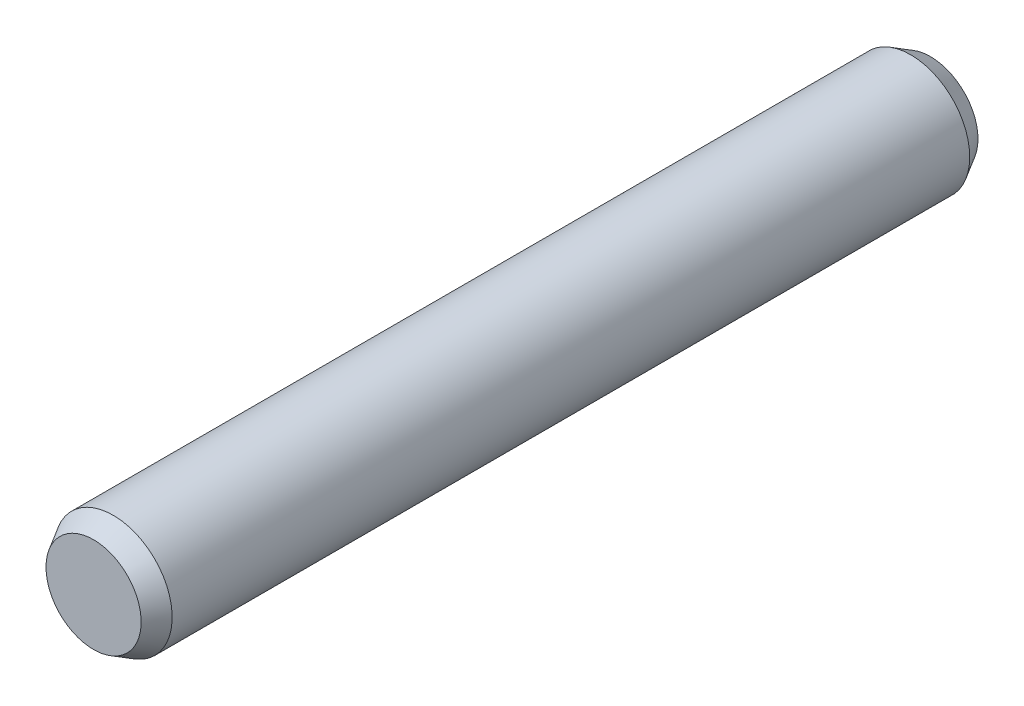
ISO-10303-21;
HEADER;
FILE_DESCRIPTION(('STEP AP214'),'2;1');
FILE_NAME('part.step','',(''),(''),'','','');
FILE_SCHEMA(('AUTOMOTIVE_DESIGN { 1 0 10303 214 1 1 1 1 }'));
ENDSEC;
DATA;
#1=APPLICATION_CONTEXT('core data for automotive mechanical design processes');
#2=APPLICATION_PROTOCOL_DEFINITION('international standard','automotive_design',2000,#1);
#3=PRODUCT_CONTEXT('',#1,'mechanical');
#4=PRODUCT('Part','Part','',(#3));
#5=PRODUCT_RELATED_PRODUCT_CATEGORY('part','',(#4));
#6=PRODUCT_DEFINITION_FORMATION('','',#4);
#7=PRODUCT_DEFINITION_CONTEXT('part definition',#1,'design');
#8=PRODUCT_DEFINITION('design','',#6,#7);
#9=PRODUCT_DEFINITION_SHAPE('','',#8);
#10=(LENGTH_UNIT() NAMED_UNIT(*) SI_UNIT(.MILLI.,.METRE.));
#11=(NAMED_UNIT(*) PLANE_ANGLE_UNIT() SI_UNIT($,.RADIAN.));
#12=(NAMED_UNIT(*) SI_UNIT($,.STERADIAN.) SOLID_ANGLE_UNIT());
#13=UNCERTAINTY_MEASURE_WITH_UNIT(LENGTH_MEASURE(1.E-05),#10,'distance_accuracy_value','');
#14=(GEOMETRIC_REPRESENTATION_CONTEXT(3) GLOBAL_UNCERTAINTY_ASSIGNED_CONTEXT((#13)) GLOBAL_UNIT_ASSIGNED_CONTEXT((#10,
#11,#12)) REPRESENTATION_CONTEXT('',''));
#15=CARTESIAN_POINT('',(0.,0.,0.));
#16=DIRECTION('',(0.,0.,1.));
#17=DIRECTION('',(1.,0.,0.));
#18=AXIS2_PLACEMENT_3D('',#15,#16,#17);
#19=CARTESIAN_POINT('',(0.,1.21132486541,-10.65));
#20=DIRECTION('',(0.,0.,-1.));
#21=DIRECTION('',(-1.,0.,0.));
#22=AXIS2_PLACEMENT_3D('',#19,#20,#21);
#23=PLANE('',#22);
#24=CARTESIAN_POINT('',(0.,0.,-10.6499999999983));
#25=DIRECTION('',(0.,0.,1.));
#26=DIRECTION('',(1.,0.,0.));
#27=AXIS2_PLACEMENT_3D('',#24,#25,#26);
#28=CIRCLE('',#27,1.21132486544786);
#29=CARTESIAN_POINT('',(1.21132486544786,0.,-10.6499999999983));
#30=VERTEX_POINT('',#29);
#31=EDGE_CURVE('E18',#30,#30,#28,.T.);
#32=ORIENTED_EDGE('',*,*,#31,.F.);
#33=EDGE_LOOP('',(#32));
#34=FACE_BOUND('',#33,.T.);
#35=ADVANCED_FACE('F15',(#34),#23,.T.);
#36=CARTESIAN_POINT('',(0.,0.,10.65));
#37=DIRECTION('',(0.,0.,-1.));
#38=DIRECTION('',(-1.,0.,0.));
#39=AXIS2_PLACEMENT_3D('',#36,#37,#38);
#40=PLANE('',#39);
#41=CARTESIAN_POINT('',(0.,0.,10.6499999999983));
#42=DIRECTION('',(0.,0.,-1.));
#43=DIRECTION('',(-1.,0.,0.));
#44=AXIS2_PLACEMENT_3D('',#41,#42,#43);
#45=CIRCLE('',#44,1.21132486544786);
#46=CARTESIAN_POINT('',(-1.21132486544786,0.,10.6499999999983));
#47=VERTEX_POINT('',#46);
#48=EDGE_CURVE('E27',#47,#47,#45,.T.);
#49=ORIENTED_EDGE('',*,*,#48,.F.);
#50=EDGE_LOOP('',(#49));
#51=FACE_BOUND('',#50,.T.);
#52=ADVANCED_FACE('F42',(#51),#40,.F.);
#53=CARTESIAN_POINT('',(0.,0.,-10.1500000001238));
#54=DIRECTION('',(0.,0.,1.));
#55=DIRECTION('',(1.,0.,0.));
#56=AXIS2_PLACEMENT_3D('',#53,#54,#55);
#57=CONICAL_SURFACE('',#56,1.49999999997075,0.523598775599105);
#58=CARTESIAN_POINT('',(0.,0.,-10.15));
#59=DIRECTION('',(0.,0.,-1.));
#60=DIRECTION('',(-1.,0.,0.));
#61=AXIS2_PLACEMENT_3D('',#58,#59,#60);
#62=CIRCLE('',#61,1.5);
#63=CARTESIAN_POINT('',(-1.5,0.,-10.15));
#64=VERTEX_POINT('',#63);
#65=EDGE_CURVE('E22',#64,#64,#62,.F.);
#66=ORIENTED_EDGE('',*,*,#65,.F.);
#67=EDGE_LOOP('',(#66));
#68=FACE_BOUND('',#67,.T.);
#69=ORIENTED_EDGE('',*,*,#31,.T.);
#70=EDGE_LOOP('',(#69));
#71=FACE_BOUND('',#70,.T.);
#72=ADVANCED_FACE('F39',(#68,#71),#57,.T.);
#73=CARTESIAN_POINT('',(0.,0.,10.1500000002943));
#74=DIRECTION('',(0.,0.,-1.));
#75=DIRECTION('',(-1.,0.,0.));
#76=AXIS2_PLACEMENT_3D('',#73,#74,#75);
#77=CONICAL_SURFACE('',#76,1.49999999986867,0.52359877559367);
#78=ORIENTED_EDGE('',*,*,#48,.T.);
#79=EDGE_LOOP('',(#78));
#80=FACE_BOUND('',#79,.T.);
#81=CARTESIAN_POINT('',(0.,0.,10.1500000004));
#82=DIRECTION('',(0.,0.,-1.));
#83=DIRECTION('',(-1.,0.,0.));
#84=AXIS2_PLACEMENT_3D('',#81,#82,#83);
#85=CIRCLE('',#84,1.5);
#86=CARTESIAN_POINT('',(-1.5,0.,10.1500000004));
#87=VERTEX_POINT('',#86);
#88=EDGE_CURVE('E10',#87,#87,#85,.T.);
#89=ORIENTED_EDGE('',*,*,#88,.F.);
#90=EDGE_LOOP('',(#89));
#91=FACE_BOUND('',#90,.T.);
#92=ADVANCED_FACE('F50',(#80,#91),#77,.T.);
#93=CARTESIAN_POINT('',(0.,0.,0.));
#94=DIRECTION('',(0.,0.,-1.));
#95=DIRECTION('',(-1.,0.,0.));
#96=AXIS2_PLACEMENT_3D('',#93,#94,#95);
#97=CYLINDRICAL_SURFACE('',#96,1.5);
#98=ORIENTED_EDGE('',*,*,#88,.T.);
#99=EDGE_LOOP('',(#98));
#100=FACE_BOUND('',#99,.T.);
#101=ORIENTED_EDGE('',*,*,#65,.T.);
#102=EDGE_LOOP('',(#101));
#103=FACE_BOUND('',#102,.T.);
#104=ADVANCED_FACE('F48',(#100,#103),#97,.T.);
#105=CLOSED_SHELL('',(#35,#52,#72,#92,#104));
#106=MANIFOLD_SOLID_BREP('B1',#105);
#107=ADVANCED_BREP_SHAPE_REPRESENTATION('',(#18,#106),#14);
#108=SHAPE_DEFINITION_REPRESENTATION(#9,#107);
ENDSEC;
END-ISO-10303-21;
